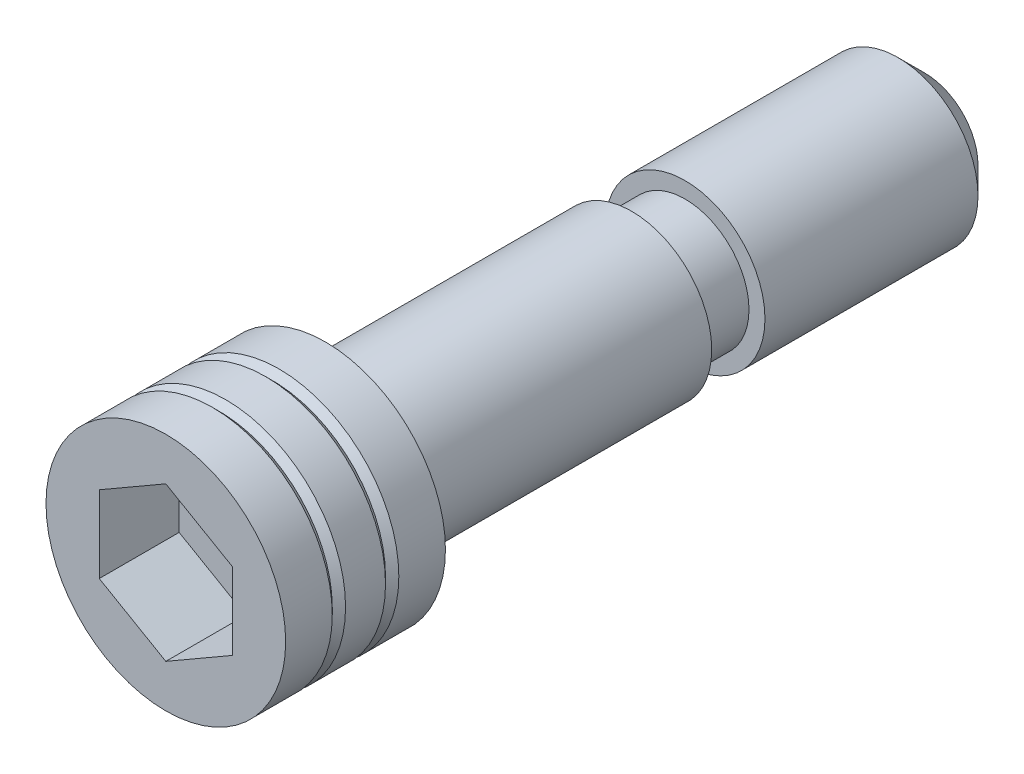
ISO-10303-21;
HEADER;
FILE_DESCRIPTION(('STEP AP214'),'2;1');
FILE_NAME('part.step','',(''),(''),'','','');
FILE_SCHEMA(('AUTOMOTIVE_DESIGN { 1 0 10303 214 1 1 1 1 }'));
ENDSEC;
DATA;
#1=APPLICATION_CONTEXT('core data for automotive mechanical design processes');
#2=APPLICATION_PROTOCOL_DEFINITION('international standard','automotive_design',2000,#1);
#3=PRODUCT_CONTEXT('',#1,'mechanical');
#4=PRODUCT('Part','Part','',(#3));
#5=PRODUCT_RELATED_PRODUCT_CATEGORY('part','',(#4));
#6=PRODUCT_DEFINITION_FORMATION('','',#4);
#7=PRODUCT_DEFINITION_CONTEXT('part definition',#1,'design');
#8=PRODUCT_DEFINITION('design','',#6,#7);
#9=PRODUCT_DEFINITION_SHAPE('','',#8);
#10=(LENGTH_UNIT() NAMED_UNIT(*) SI_UNIT(.MILLI.,.METRE.));
#11=(NAMED_UNIT(*) PLANE_ANGLE_UNIT() SI_UNIT($,.RADIAN.));
#12=(NAMED_UNIT(*) SI_UNIT($,.STERADIAN.) SOLID_ANGLE_UNIT());
#13=UNCERTAINTY_MEASURE_WITH_UNIT(LENGTH_MEASURE(1.E-05),#10,'distance_accuracy_value','');
#14=(GEOMETRIC_REPRESENTATION_CONTEXT(3) GLOBAL_UNCERTAINTY_ASSIGNED_CONTEXT((#13)) GLOBAL_UNIT_ASSIGNED_CONTEXT((#10,
#11,#12)) REPRESENTATION_CONTEXT('',''));
#15=CARTESIAN_POINT('',(0.,0.,0.));
#16=DIRECTION('',(0.,0.,1.));
#17=DIRECTION('',(1.,0.,0.));
#18=AXIS2_PLACEMENT_3D('',#15,#16,#17);
#19=CARTESIAN_POINT('',(0.,0.,35.));
#20=DIRECTION('',(0.,0.,1.));
#21=DIRECTION('',(1.,0.,0.));
#22=AXIS2_PLACEMENT_3D('',#19,#20,#21);
#23=CYLINDRICAL_SURFACE('',#22,9.);
#24=CARTESIAN_POINT('',(0.,0.,4.5));
#25=DIRECTION('',(0.,0.,1.));
#26=DIRECTION('',(1.,0.,0.));
#27=AXIS2_PLACEMENT_3D('',#24,#25,#26);
#28=CIRCLE('',#27,9.);
#29=CARTESIAN_POINT('',(9.,0.,4.5));
#30=VERTEX_POINT('',#29);
#31=EDGE_CURVE('E147',#30,#30,#28,.F.);
#32=ORIENTED_EDGE('',*,*,#31,.F.);
#33=EDGE_LOOP('',(#32));
#34=FACE_BOUND('',#33,.T.);
#35=CARTESIAN_POINT('',(0.,0.,7.5));
#36=DIRECTION('',(0.,0.,-1.));
#37=DIRECTION('',(-1.,0.,0.));
#38=AXIS2_PLACEMENT_3D('',#35,#36,#37);
#39=CIRCLE('',#38,9.);
#40=CARTESIAN_POINT('',(-9.,0.,7.5));
#41=VERTEX_POINT('',#40);
#42=EDGE_CURVE('E18',#41,#41,#39,.F.);
#43=ORIENTED_EDGE('',*,*,#42,.F.);
#44=EDGE_LOOP('',(#43));
#45=FACE_BOUND('',#44,.T.);
#46=ADVANCED_FACE('F14',(#34,#45),#23,.T.);
#47=CARTESIAN_POINT('',(0.,0.,0.));
#48=DIRECTION('',(0.,0.,1.));
#49=DIRECTION('',(1.,0.,0.));
#50=AXIS2_PLACEMENT_3D('',#47,#48,#49);
#51=CIRCLE('',#50,9.);
#52=CARTESIAN_POINT('',(9.,0.,0.));
#53=VERTEX_POINT('',#52);
#54=EDGE_CURVE('E23',#53,#53,#51,.T.);
#55=ORIENTED_EDGE('',*,*,#54,.T.);
#56=EDGE_LOOP('',(#55));
#57=FACE_BOUND('',#56,.T.);
#58=CARTESIAN_POINT('',(0.,0.,3.5));
#59=DIRECTION('',(0.,0.,-1.));
#60=DIRECTION('',(-1.,0.,0.));
#61=AXIS2_PLACEMENT_3D('',#58,#59,#60);
#62=CIRCLE('',#61,9.);
#63=CARTESIAN_POINT('',(-9.,0.,3.5));
#64=VERTEX_POINT('',#63);
#65=EDGE_CURVE('E150',#64,#64,#62,.F.);
#66=ORIENTED_EDGE('',*,*,#65,.F.);
#67=EDGE_LOOP('',(#66));
#68=FACE_BOUND('',#67,.T.);
#69=ADVANCED_FACE('F179',(#57,#68),#23,.T.);
#70=CARTESIAN_POINT('',(-6.,0.,0.));
#71=DIRECTION('',(0.,0.,1.));
#72=DIRECTION('',(1.,0.,0.));
#73=AXIS2_PLACEMENT_3D('',#70,#71,#72);
#74=PLANE('',#73);
#75=ORIENTED_EDGE('',*,*,#54,.F.);
#76=EDGE_LOOP('',(#75));
#77=FACE_BOUND('',#76,.T.);
#78=CARTESIAN_POINT('',(0.,0.,0.));
#79=DIRECTION('',(0.,0.,1.));
#80=DIRECTION('',(1.,0.,0.));
#81=AXIS2_PLACEMENT_3D('',#78,#79,#80);
#82=CIRCLE('',#81,6.);
#83=CARTESIAN_POINT('',(6.,0.,0.));
#84=VERTEX_POINT('',#83);
#85=EDGE_CURVE('E142',#84,#84,#82,.T.);
#86=ORIENTED_EDGE('',*,*,#85,.T.);
#87=EDGE_LOOP('',(#86));
#88=FACE_BOUND('',#87,.T.);
#89=ADVANCED_FACE('F244',(#77,#88),#74,.F.);
#90=CARTESIAN_POINT('',(0.,0.,35.));
#91=DIRECTION('',(0.,0.,1.));
#92=DIRECTION('',(1.,0.,0.));
#93=AXIS2_PLACEMENT_3D('',#90,#91,#92);
#94=CYLINDRICAL_SURFACE('',#93,6.);
#95=ORIENTED_EDGE('',*,*,#85,.F.);
#96=EDGE_LOOP('',(#95));
#97=FACE_BOUND('',#96,.T.);
#98=CARTESIAN_POINT('',(0.,0.,-23.));
#99=DIRECTION('',(0.,0.,1.));
#100=DIRECTION('',(1.,0.,0.));
#101=AXIS2_PLACEMENT_3D('',#98,#99,#100);
#102=CIRCLE('',#101,6.);
#103=CARTESIAN_POINT('',(6.,0.,-23.));
#104=VERTEX_POINT('',#103);
#105=EDGE_CURVE('E139',#104,#104,#102,.T.);
#106=ORIENTED_EDGE('',*,*,#105,.T.);
#107=EDGE_LOOP('',(#106));
#108=FACE_BOUND('',#107,.T.);
#109=ADVANCED_FACE('F240',(#97,#108),#94,.T.);
#110=CARTESIAN_POINT('',(-4.8,0.,-23.));
#111=DIRECTION('',(0.,0.,1.));
#112=DIRECTION('',(1.,0.,0.));
#113=AXIS2_PLACEMENT_3D('',#110,#111,#112);
#114=PLANE('',#113);
#115=ORIENTED_EDGE('',*,*,#105,.F.);
#116=EDGE_LOOP('',(#115));
#117=FACE_BOUND('',#116,.T.);
#118=CARTESIAN_POINT('',(0.,0.,-23.));
#119=DIRECTION('',(0.,0.,1.));
#120=DIRECTION('',(1.,0.,0.));
#121=AXIS2_PLACEMENT_3D('',#118,#119,#120);
#122=CIRCLE('',#121,4.8);
#123=CARTESIAN_POINT('',(4.8,0.,-23.));
#124=VERTEX_POINT('',#123);
#125=EDGE_CURVE('E136',#124,#124,#122,.T.);
#126=ORIENTED_EDGE('',*,*,#125,.T.);
#127=EDGE_LOOP('',(#126));
#128=FACE_BOUND('',#127,.T.);
#129=ADVANCED_FACE('F236',(#117,#128),#114,.F.);
#130=CARTESIAN_POINT('',(0.,0.,35.));
#131=DIRECTION('',(0.,0.,1.));
#132=DIRECTION('',(1.,0.,0.));
#133=AXIS2_PLACEMENT_3D('',#130,#131,#132);
#134=CYLINDRICAL_SURFACE('',#133,4.8);
#135=ORIENTED_EDGE('',*,*,#125,.F.);
#136=EDGE_LOOP('',(#135));
#137=FACE_BOUND('',#136,.T.);
#138=CARTESIAN_POINT('',(0.,0.,-27.));
#139=DIRECTION('',(0.,0.,1.));
#140=DIRECTION('',(1.,0.,0.));
#141=AXIS2_PLACEMENT_3D('',#138,#139,#140);
#142=CIRCLE('',#141,4.8);
#143=CARTESIAN_POINT('',(4.8,0.,-27.));
#144=VERTEX_POINT('',#143);
#145=EDGE_CURVE('E133',#144,#144,#142,.T.);
#146=ORIENTED_EDGE('',*,*,#145,.T.);
#147=EDGE_LOOP('',(#146));
#148=FACE_BOUND('',#147,.T.);
#149=ADVANCED_FACE('F232',(#137,#148),#134,.T.);
#150=CARTESIAN_POINT('',(-6.,0.,-27.));
#151=DIRECTION('',(0.,0.,-1.));
#152=DIRECTION('',(-1.,0.,0.));
#153=AXIS2_PLACEMENT_3D('',#150,#151,#152);
#154=PLANE('',#153);
#155=ORIENTED_EDGE('',*,*,#145,.F.);
#156=EDGE_LOOP('',(#155));
#157=FACE_BOUND('',#156,.T.);
#158=CARTESIAN_POINT('',(0.,0.,-27.));
#159=DIRECTION('',(0.,0.,1.));
#160=DIRECTION('',(1.,0.,0.));
#161=AXIS2_PLACEMENT_3D('',#158,#159,#160);
#162=CIRCLE('',#161,6.);
#163=CARTESIAN_POINT('',(6.,0.,-27.));
#164=VERTEX_POINT('',#163);
#165=EDGE_CURVE('E130',#164,#164,#162,.T.);
#166=ORIENTED_EDGE('',*,*,#165,.T.);
#167=EDGE_LOOP('',(#166));
#168=FACE_BOUND('',#167,.T.);
#169=ADVANCED_FACE('F228',(#157,#168),#154,.F.);
#170=CARTESIAN_POINT('',(0.,0.,35.));
#171=DIRECTION('',(0.,0.,1.));
#172=DIRECTION('',(1.,0.,0.));
#173=AXIS2_PLACEMENT_3D('',#170,#171,#172);
#174=CYLINDRICAL_SURFACE('',#173,6.);
#175=ORIENTED_EDGE('',*,*,#165,.F.);
#176=EDGE_LOOP('',(#175));
#177=FACE_BOUND('',#176,.T.);
#178=CARTESIAN_POINT('',(0.,0.,-43.));
#179=DIRECTION('',(0.,0.,1.));
#180=DIRECTION('',(1.,0.,0.));
#181=AXIS2_PLACEMENT_3D('',#178,#179,#180);
#182=CIRCLE('',#181,6.);
#183=CARTESIAN_POINT('',(6.,0.,-43.));
#184=VERTEX_POINT('',#183);
#185=EDGE_CURVE('E127',#184,#184,#182,.T.);
#186=ORIENTED_EDGE('',*,*,#185,.T.);
#187=EDGE_LOOP('',(#186));
#188=FACE_BOUND('',#187,.T.);
#189=ADVANCED_FACE('F224',(#177,#188),#174,.T.);
#190=CARTESIAN_POINT('',(0.,0.,-45.));
#191=DIRECTION('',(0.,0.,1.));
#192=DIRECTION('',(1.,0.,0.));
#193=AXIS2_PLACEMENT_3D('',#190,#191,#192);
#194=CONICAL_SURFACE('',#193,4.,0.785398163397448);
#195=ORIENTED_EDGE('',*,*,#185,.F.);
#196=EDGE_LOOP('',(#195));
#197=FACE_BOUND('',#196,.T.);
#198=CARTESIAN_POINT('',(0.,0.,-45.));
#199=DIRECTION('',(0.,0.,1.));
#200=DIRECTION('',(1.,0.,0.));
#201=AXIS2_PLACEMENT_3D('',#198,#199,#200);
#202=CIRCLE('',#201,4.);
#203=CARTESIAN_POINT('',(4.,0.,-45.));
#204=VERTEX_POINT('',#203);
#205=EDGE_CURVE('E118',#204,#204,#202,.T.);
#206=ORIENTED_EDGE('',*,*,#205,.T.);
#207=EDGE_LOOP('',(#206));
#208=FACE_BOUND('',#207,.T.);
#209=ADVANCED_FACE('F220',(#197,#208),#194,.T.);
#210=CARTESIAN_POINT('',(0.,0.,-45.));
#211=DIRECTION('',(0.,0.,1.));
#212=DIRECTION('',(1.,0.,0.));
#213=AXIS2_PLACEMENT_3D('',#210,#211,#212);
#214=PLANE('',#213);
#215=ORIENTED_EDGE('',*,*,#205,.F.);
#216=EDGE_LOOP('',(#215));
#217=FACE_BOUND('',#216,.T.);
#218=ADVANCED_FACE('F196',(#217),#214,.F.);
#219=CARTESIAN_POINT('',(0.,0.,3.34060499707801));
#220=DIRECTION('',(0.,0.,-1.));
#221=DIRECTION('',(-1.,0.,0.));
#222=AXIS2_PLACEMENT_3D('',#219,#220,#221);
#223=CONICAL_SURFACE('',#222,9.159395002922,0.785398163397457);
#224=CARTESIAN_POINT('',(0.,0.,4.));
#225=DIRECTION('',(0.,0.,-1.));
#226=DIRECTION('',(-1.,0.,0.));
#227=AXIS2_PLACEMENT_3D('',#224,#225,#226);
#228=CIRCLE('',#227,8.5);
#229=CARTESIAN_POINT('',(-8.5,0.,4.));
#230=VERTEX_POINT('',#229);
#231=EDGE_CURVE('E151',#230,#230,#228,.T.);
#232=ORIENTED_EDGE('',*,*,#231,.T.);
#233=EDGE_LOOP('',(#232));
#234=FACE_BOUND('',#233,.T.);
#235=ORIENTED_EDGE('',*,*,#65,.T.);
#236=EDGE_LOOP('',(#235));
#237=FACE_BOUND('',#236,.T.);
#238=ADVANCED_FACE('F167',(#234,#237),#223,.T.);
#239=CARTESIAN_POINT('',(0.,0.,4.));
#240=DIRECTION('',(0.,0.,1.));
#241=DIRECTION('',(1.,0.,0.));
#242=AXIS2_PLACEMENT_3D('',#239,#240,#241);
#243=CONICAL_SURFACE('',#242,8.5,0.785398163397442);
#244=ORIENTED_EDGE('',*,*,#231,.F.);
#245=EDGE_LOOP('',(#244));
#246=FACE_BOUND('',#245,.T.);
#247=ORIENTED_EDGE('',*,*,#31,.T.);
#248=EDGE_LOOP('',(#247));
#249=FACE_BOUND('',#248,.T.);
#250=ADVANCED_FACE('F170',(#246,#249),#243,.T.);
#251=CARTESIAN_POINT('',(0.,0.,7.34060499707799));
#252=DIRECTION('',(0.,0.,-1.));
#253=DIRECTION('',(-1.,0.,0.));
#254=AXIS2_PLACEMENT_3D('',#251,#252,#253);
#255=CONICAL_SURFACE('',#254,9.159395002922,0.785398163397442);
#256=CARTESIAN_POINT('',(0.,0.,8.));
#257=DIRECTION('',(0.,0.,-1.));
#258=DIRECTION('',(-1.,0.,0.));
#259=AXIS2_PLACEMENT_3D('',#256,#257,#258);
#260=CIRCLE('',#259,8.5);
#261=CARTESIAN_POINT('',(-8.5,0.,8.));
#262=VERTEX_POINT('',#261);
#263=EDGE_CURVE('E155',#262,#262,#260,.T.);
#264=ORIENTED_EDGE('',*,*,#263,.T.);
#265=EDGE_LOOP('',(#264));
#266=FACE_BOUND('',#265,.T.);
#267=ORIENTED_EDGE('',*,*,#42,.T.);
#268=EDGE_LOOP('',(#267));
#269=FACE_BOUND('',#268,.T.);
#270=ADVANCED_FACE('F173',(#266,#269),#255,.T.);
#271=CARTESIAN_POINT('',(0.,0.,8.));
#272=DIRECTION('',(0.,0.,1.));
#273=DIRECTION('',(1.,0.,0.));
#274=AXIS2_PLACEMENT_3D('',#271,#272,#273);
#275=CONICAL_SURFACE('',#274,8.5,0.785398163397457);
#276=ORIENTED_EDGE('',*,*,#263,.F.);
#277=EDGE_LOOP('',(#276));
#278=FACE_BOUND('',#277,.T.);
#279=CARTESIAN_POINT('',(0.,0.,8.5));
#280=DIRECTION('',(0.,0.,1.));
#281=DIRECTION('',(1.,0.,0.));
#282=AXIS2_PLACEMENT_3D('',#279,#280,#281);
#283=CIRCLE('',#282,9.);
#284=CARTESIAN_POINT('',(9.,0.,8.5));
#285=VERTEX_POINT('',#284);
#286=EDGE_CURVE('E153',#285,#285,#283,.F.);
#287=ORIENTED_EDGE('',*,*,#286,.T.);
#288=EDGE_LOOP('',(#287));
#289=FACE_BOUND('',#288,.T.);
#290=ADVANCED_FACE('F184',(#278,#289),#275,.T.);
#291=CARTESIAN_POINT('',(5.,2.88675134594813,6.));
#292=DIRECTION('',(0.,0.,-1.));
#293=DIRECTION('',(-1.,0.,0.));
#294=AXIS2_PLACEMENT_3D('',#291,#292,#293);
#295=PLANE('',#294);
#296=DIRECTION('',(-0.866025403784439,0.5,0.));
#297=VECTOR('',#296,1.);
#298=CARTESIAN_POINT('',(5.,2.88675134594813,6.));
#299=LINE('',#298,#297);
#300=CARTESIAN_POINT('',(5.,2.88675134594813,6.));
#301=VERTEX_POINT('',#300);
#302=CARTESIAN_POINT('',(0.,5.77350269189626,6.));
#303=VERTEX_POINT('',#302);
#304=EDGE_CURVE('E102',#301,#303,#299,.T.);
#305=ORIENTED_EDGE('',*,*,#304,.T.);
#306=DIRECTION('',(-0.866025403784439,-0.5,0.));
#307=VECTOR('',#306,1.);
#308=CARTESIAN_POINT('',(0.,5.77350269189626,6.));
#309=LINE('',#308,#307);
#310=CARTESIAN_POINT('',(-5.,2.88675134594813,6.));
#311=VERTEX_POINT('',#310);
#312=EDGE_CURVE('E105',#303,#311,#309,.T.);
#313=ORIENTED_EDGE('',*,*,#312,.T.);
#314=DIRECTION('',(0.,-1.,0.));
#315=VECTOR('',#314,1.);
#316=CARTESIAN_POINT('',(-5.,2.88675134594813,6.));
#317=LINE('',#316,#315);
#318=CARTESIAN_POINT('',(-5.,-2.88675134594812,6.));
#319=VERTEX_POINT('',#318);
#320=EDGE_CURVE('E77',#311,#319,#317,.T.);
#321=ORIENTED_EDGE('',*,*,#320,.T.);
#322=DIRECTION('',(0.866025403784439,-0.5,0.));
#323=VECTOR('',#322,1.);
#324=CARTESIAN_POINT('',(-5.,-2.88675134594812,6.));
#325=LINE('',#324,#323);
#326=CARTESIAN_POINT('',(0.,-5.77350269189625,6.));
#327=VERTEX_POINT('',#326);
#328=EDGE_CURVE('E108',#319,#327,#325,.T.);
#329=ORIENTED_EDGE('',*,*,#328,.T.);
#330=DIRECTION('',(0.866025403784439,0.5,0.));
#331=VECTOR('',#330,1.);
#332=CARTESIAN_POINT('',(0.,-5.77350269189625,6.));
#333=LINE('',#332,#331);
#334=CARTESIAN_POINT('',(5.,-2.88675134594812,6.));
#335=VERTEX_POINT('',#334);
#336=EDGE_CURVE('E111',#327,#335,#333,.T.);
#337=ORIENTED_EDGE('',*,*,#336,.T.);
#338=DIRECTION('',(0.,1.,0.));
#339=VECTOR('',#338,1.);
#340=CARTESIAN_POINT('',(5.,-2.88675134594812,6.));
#341=LINE('',#340,#339);
#342=EDGE_CURVE('E114',#335,#301,#341,.T.);
#343=ORIENTED_EDGE('',*,*,#342,.T.);
#344=EDGE_LOOP('',(#305,#313,#321,#329,#337,#343));
#345=FACE_BOUND('',#344,.T.);
#346=ADVANCED_FACE('F190',(#345),#295,.F.);
#347=CARTESIAN_POINT('',(-5.,2.88675134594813,6.));
#348=DIRECTION('',(-1.,0.,0.));
#349=DIRECTION('',(0.,0.,1.));
#350=AXIS2_PLACEMENT_3D('',#347,#348,#349);
#351=PLANE('',#350);
#352=DIRECTION('',(0.,-1.,0.));
#353=VECTOR('',#352,1.);
#354=CARTESIAN_POINT('',(-5.,2.88675134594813,12.));
#355=LINE('',#354,#353);
#356=CARTESIAN_POINT('',(-5.,2.88675134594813,12.));
#357=VERTEX_POINT('',#356);
#358=CARTESIAN_POINT('',(-5.,-2.88675134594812,12.));
#359=VERTEX_POINT('',#358);
#360=EDGE_CURVE('E74',#357,#359,#355,.T.);
#361=ORIENTED_EDGE('',*,*,#360,.T.);
#362=DIRECTION('',(0.,0.,1.));
#363=VECTOR('',#362,1.);
#364=CARTESIAN_POINT('',(-5.,-2.88675134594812,6.));
#365=LINE('',#364,#363);
#366=EDGE_CURVE('E81',#319,#359,#365,.T.);
#367=ORIENTED_EDGE('',*,*,#366,.F.);
#368=ORIENTED_EDGE('',*,*,#320,.F.);
#369=DIRECTION('',(0.,0.,1.));
#370=VECTOR('',#369,1.);
#371=CARTESIAN_POINT('',(-5.,2.88675134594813,6.));
#372=LINE('',#371,#370);
#373=EDGE_CURVE('E70',#311,#357,#372,.T.);
#374=ORIENTED_EDGE('',*,*,#373,.T.);
#375=EDGE_LOOP('',(#361,#367,#368,#374));
#376=FACE_BOUND('',#375,.T.);
#377=ADVANCED_FACE('F72',(#376),#351,.F.);
#378=CARTESIAN_POINT('',(-5.,-2.88675134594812,6.));
#379=DIRECTION('',(-0.5,-0.866025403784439,0.));
#380=DIRECTION('',(0.866025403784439,-0.5,0.));
#381=AXIS2_PLACEMENT_3D('',#378,#379,#380);
#382=PLANE('',#381);
#383=DIRECTION('',(0.866025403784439,-0.5,0.));
#384=VECTOR('',#383,1.);
#385=CARTESIAN_POINT('',(-5.,-2.88675134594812,12.));
#386=LINE('',#385,#384);
#387=CARTESIAN_POINT('',(0.,-5.77350269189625,12.));
#388=VERTEX_POINT('',#387);
#389=EDGE_CURVE('E92',#359,#388,#386,.T.);
#390=ORIENTED_EDGE('',*,*,#389,.T.);
#391=DIRECTION('',(0.,0.,1.));
#392=VECTOR('',#391,1.);
#393=CARTESIAN_POINT('',(0.,-5.77350269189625,6.));
#394=LINE('',#393,#392);
#395=EDGE_CURVE('E121',#327,#388,#394,.T.);
#396=ORIENTED_EDGE('',*,*,#395,.F.);
#397=ORIENTED_EDGE('',*,*,#328,.F.);
#398=ORIENTED_EDGE('',*,*,#366,.T.);
#399=EDGE_LOOP('',(#390,#396,#397,#398));
#400=FACE_BOUND('',#399,.T.);
#401=ADVANCED_FACE('F207',(#400),#382,.F.);
#402=CARTESIAN_POINT('',(0.,-5.77350269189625,6.));
#403=DIRECTION('',(0.5,-0.866025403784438,0.));
#404=DIRECTION('',(0.866025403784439,0.5,0.));
#405=AXIS2_PLACEMENT_3D('',#402,#403,#404);
#406=PLANE('',#405);
#407=DIRECTION('',(0.866025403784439,0.5,0.));
#408=VECTOR('',#407,1.);
#409=CARTESIAN_POINT('',(0.,-5.77350269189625,12.));
#410=LINE('',#409,#408);
#411=CARTESIAN_POINT('',(5.,-2.88675134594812,12.));
#412=VERTEX_POINT('',#411);
#413=EDGE_CURVE('E94',#388,#412,#410,.T.);
#414=ORIENTED_EDGE('',*,*,#413,.T.);
#415=DIRECTION('',(0.,0.,1.));
#416=VECTOR('',#415,1.);
#417=CARTESIAN_POINT('',(5.,-2.88675134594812,6.));
#418=LINE('',#417,#416);
#419=EDGE_CURVE('E119',#335,#412,#418,.T.);
#420=ORIENTED_EDGE('',*,*,#419,.F.);
#421=ORIENTED_EDGE('',*,*,#336,.F.);
#422=ORIENTED_EDGE('',*,*,#395,.T.);
#423=EDGE_LOOP('',(#414,#420,#421,#422));
#424=FACE_BOUND('',#423,.T.);
#425=ADVANCED_FACE('F204',(#424),#406,.F.);
#426=CARTESIAN_POINT('',(5.,-2.88675134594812,6.));
#427=DIRECTION('',(1.,0.,0.));
#428=DIRECTION('',(0.,0.,-1.));
#429=AXIS2_PLACEMENT_3D('',#426,#427,#428);
#430=PLANE('',#429);
#431=DIRECTION('',(0.,1.,0.));
#432=VECTOR('',#431,1.);
#433=CARTESIAN_POINT('',(5.,-2.88675134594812,12.));
#434=LINE('',#433,#432);
#435=CARTESIAN_POINT('',(5.,2.88675134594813,12.));
#436=VERTEX_POINT('',#435);
#437=EDGE_CURVE('E100',#412,#436,#434,.T.);
#438=ORIENTED_EDGE('',*,*,#437,.T.);
#439=DIRECTION('',(0.,0.,1.));
#440=VECTOR('',#439,1.);
#441=CARTESIAN_POINT('',(5.,2.88675134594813,6.));
#442=LINE('',#441,#440);
#443=EDGE_CURVE('E38',#301,#436,#442,.T.);
#444=ORIENTED_EDGE('',*,*,#443,.F.);
#445=ORIENTED_EDGE('',*,*,#342,.F.);
#446=ORIENTED_EDGE('',*,*,#419,.T.);
#447=EDGE_LOOP('',(#438,#444,#445,#446));
#448=FACE_BOUND('',#447,.T.);
#449=ADVANCED_FACE('F200',(#448),#430,.F.);
#450=CARTESIAN_POINT('',(5.,2.88675134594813,6.));
#451=DIRECTION('',(0.5,0.866025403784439,0.));
#452=DIRECTION('',(-0.866025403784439,0.5,0.));
#453=AXIS2_PLACEMENT_3D('',#450,#451,#452);
#454=PLANE('',#453);
#455=DIRECTION('',(-0.866025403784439,0.5,0.));
#456=VECTOR('',#455,1.);
#457=CARTESIAN_POINT('',(5.,2.88675134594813,12.));
#458=LINE('',#457,#456);
#459=CARTESIAN_POINT('',(0.,5.77350269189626,12.));
#460=VERTEX_POINT('',#459);
#461=EDGE_CURVE('E31',#436,#460,#458,.T.);
#462=ORIENTED_EDGE('',*,*,#461,.T.);
#463=DIRECTION('',(0.,0.,1.));
#464=VECTOR('',#463,1.);
#465=CARTESIAN_POINT('',(0.,5.77350269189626,6.));
#466=LINE('',#465,#464);
#467=EDGE_CURVE('E82',#303,#460,#466,.T.);
#468=ORIENTED_EDGE('',*,*,#467,.F.);
#469=ORIENTED_EDGE('',*,*,#304,.F.);
#470=ORIENTED_EDGE('',*,*,#443,.T.);
#471=EDGE_LOOP('',(#462,#468,#469,#470));
#472=FACE_BOUND('',#471,.T.);
#473=ADVANCED_FACE('F203',(#472),#454,.F.);
#474=CARTESIAN_POINT('',(0.,5.77350269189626,6.));
#475=DIRECTION('',(-0.5,0.866025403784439,0.));
#476=DIRECTION('',(-0.866025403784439,-0.5,0.));
#477=AXIS2_PLACEMENT_3D('',#474,#475,#476);
#478=PLANE('',#477);
#479=DIRECTION('',(-0.866025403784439,-0.5,0.));
#480=VECTOR('',#479,1.);
#481=CARTESIAN_POINT('',(0.,5.77350269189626,12.));
#482=LINE('',#481,#480);
#483=EDGE_CURVE('E85',#460,#357,#482,.T.);
#484=ORIENTED_EDGE('',*,*,#483,.T.);
#485=ORIENTED_EDGE('',*,*,#373,.F.);
#486=ORIENTED_EDGE('',*,*,#312,.F.);
#487=ORIENTED_EDGE('',*,*,#467,.T.);
#488=EDGE_LOOP('',(#484,#485,#486,#487));
#489=FACE_BOUND('',#488,.T.);
#490=ADVANCED_FACE('F86',(#489),#478,.F.);
#491=CARTESIAN_POINT('',(-9.,0.,12.));
#492=DIRECTION('',(0.,0.,-1.));
#493=DIRECTION('',(-1.,0.,0.));
#494=AXIS2_PLACEMENT_3D('',#491,#492,#493);
#495=PLANE('',#494);
#496=ORIENTED_EDGE('',*,*,#483,.F.);
#497=ORIENTED_EDGE('',*,*,#461,.F.);
#498=ORIENTED_EDGE('',*,*,#437,.F.);
#499=ORIENTED_EDGE('',*,*,#413,.F.);
#500=ORIENTED_EDGE('',*,*,#389,.F.);
#501=ORIENTED_EDGE('',*,*,#360,.F.);
#502=EDGE_LOOP('',(#496,#497,#498,#499,#500,#501));
#503=FACE_BOUND('',#502,.T.);
#504=CARTESIAN_POINT('',(0.,0.,12.));
#505=DIRECTION('',(0.,0.,1.));
#506=DIRECTION('',(1.,0.,0.));
#507=AXIS2_PLACEMENT_3D('',#504,#505,#506);
#508=CIRCLE('',#507,9.);
#509=CARTESIAN_POINT('',(9.,0.,12.));
#510=VERTEX_POINT('',#509);
#511=EDGE_CURVE('E9',#510,#510,#508,.T.);
#512=ORIENTED_EDGE('',*,*,#511,.T.);
#513=EDGE_LOOP('',(#512));
#514=FACE_BOUND('',#513,.T.);
#515=ADVANCED_FACE('F16',(#503,#514),#495,.F.);
#516=ORIENTED_EDGE('',*,*,#511,.F.);
#517=EDGE_LOOP('',(#516));
#518=FACE_BOUND('',#517,.T.);
#519=ORIENTED_EDGE('',*,*,#286,.F.);
#520=EDGE_LOOP('',(#519));
#521=FACE_BOUND('',#520,.T.);
#522=ADVANCED_FACE('F180',(#518,#521),#23,.T.);
#523=CLOSED_SHELL('',(#46,#69,#89,#109,#129,#149,#169,#189,#209,#218,#238,#250,#270,#290,#346,
#377,#401,#425,#449,#473,#490,#515,#522));
#524=MANIFOLD_SOLID_BREP('B1',#523);
#525=ADVANCED_BREP_SHAPE_REPRESENTATION('',(#18,#524),#14);
#526=SHAPE_DEFINITION_REPRESENTATION(#9,#525);
ENDSEC;
END-ISO-10303-21;
